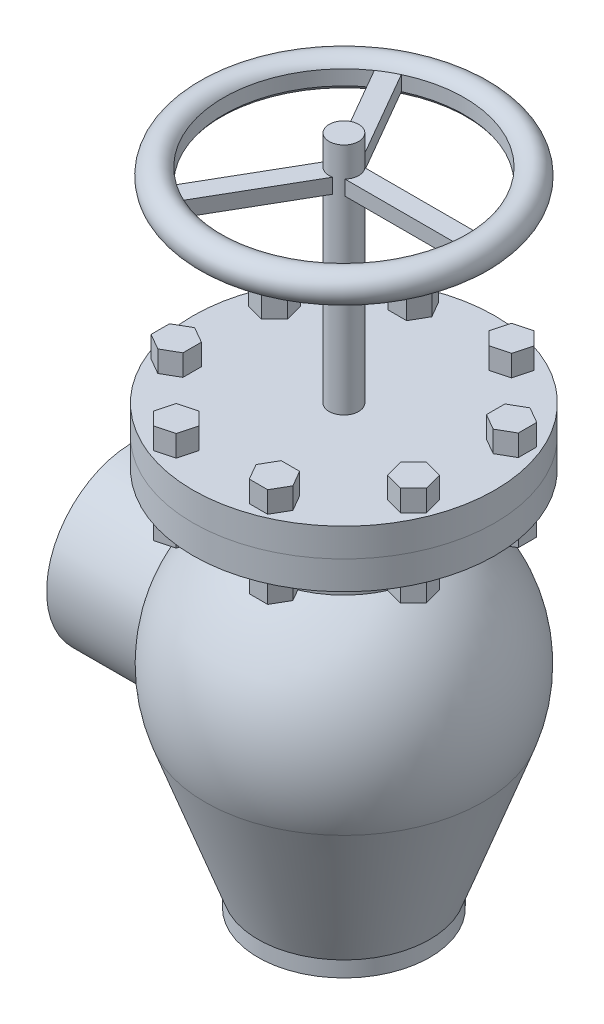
from build123d import *

# Parameters (mm, degrees)
WELD_END_SKETCH_R                = 72.263
WELD_END_DEPTH                   = 177.8
FLANGE_BOTTOM_SKETCH_R           = 127
FLANGE_BOTTOM_DEPTH              = 23.876
FLANGE_TOP_SKETCH_R              = 127
FLANGE_TOP_DEPTH                 = 23.876
CENTRE_SUPPORT_REACH             = 584.181
CENTRE_SUPPORT_SKETCH_R          = 12.446
CENTRE_SUPPORT_DIRECTION_2_DEPTH = 24.892
DRIVER_START                     = -12.446
DRIVER_CUT_DEPTH                 = 12.446
ID_PROFILE_R                     = 65.7098
BOLT_DEPTH                       = 83.566
BOLT_PATTERN_COUNT               = 8
BOLT_PATTERN_ANGLE               = 315


with BuildPart() as part:
    # Weld End Sketch → Weld End (new body)
    with BuildSketch(Plane(origin=(0, 0, 0), x_dir=(0, 0, -1), z_dir=(1, 0, 0))):
        Circle(WELD_END_SKETCH_R)
    extrude(amount=-WELD_END_DEPTH)

    # Body Sketch → Body (revolve)
    with BuildSketch(Plane.XY, mode=Mode.PRIVATE) as body_sk:
        with BuildLine():
            Line((-72.263, 142.24), (-72.263, 101.054591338))
            ThreePointArc((-72.263, 101.054591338), (-118.667388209, 36.769859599), (-116.741337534, -42.490371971))
            Line((-116.741337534, -42.490371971), (-72.263, -164.6936))
            Line((-72.263, -164.6936), (-72.263, -177.8))
            Line((-72.263, -177.8), (0, -177.8))
            Line((0, -177.8), (0, 142.24))
            Line((0, 142.24), (-72.263, 142.24))
        make_face()
    revolve(body_sk.sketch.rotate(Axis((0, -199.445830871, 0), (0, 1, 0)), 270), axis=Axis((0, -199.445830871, 0), (0, 1, 0)))

    # Flange Bottom Sketch → Flange Bottom (add)
    with BuildSketch(Plane(origin=(0, 142.24, 0), x_dir=(-1, 0, 0), z_dir=(0, 1, 0))):
        with Locations(Location((0, 0, 0), (0, 0, 90))):
            Circle(FLANGE_BOTTOM_SKETCH_R)
    extrude(amount=FLANGE_BOTTOM_DEPTH)

    # Flange Top Sketch → Flange Top (add)
    with BuildSketch(Plane(origin=(0, 166.116, 0), x_dir=(-1, 0, 0), z_dir=(0, 1, 0))):
        with Locations(Location((0, 0, 0), (0, 0, 90))):
            Circle(FLANGE_TOP_SKETCH_R)
    extrude(amount=FLANGE_TOP_DEPTH)

    # Centre Support: up to this face of the body (flat: up to its plane)
    centre_support_end = Plane(part.part.faces().sort_by_distance((0, 189.992, 0))[0])
    # Centre Support Sketch → Centre Support (add, up to the picked face)
    with BuildSketch(Plane(origin=(0, 361.823, 0), x_dir=(-1, 0, 0), z_dir=(0, 1, 0)), mode=Mode.PRIVATE) as centre_support_sk1:
        with Locations(Location((0, 0, 0), (0, 0, 90))):
            Circle(CENTRE_SUPPORT_SKETCH_R)
    centre_support_tool1 = split(extrude(centre_support_sk1.sketch, amount=-CENTRE_SUPPORT_REACH, mode=Mode.PRIVATE), bisect_by=centre_support_end, keep=Keep.BOTH, mode=Mode.PRIVATE)


with BuildPart() as body_2:
    # Driver Sweep: sweep along a path in Driver Path
    with BuildLine(Plane(origin=(0, 355.6, 0), x_dir=(-1, 0, 0), z_dir=(0, 1, 0))) as driver_sweep_path:
        CenterArc((0, 0), 124.46, 0, 360)
    # Driver Profile → Driver Sweep (sweep)
    with BuildSketch(Plane.XY):
        with BuildLine():
            Line((-101.235447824, 361.823), (0, 361.823))
            Line((0, 361.823), (0, 349.377))
            Line((0, 349.377), (-101.235447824, 349.377))
            ThreePointArc((-101.235447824, 349.377), (-124.46, 355.6), (-101.235447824, 361.823))
        make_face()
    sweep(path=driver_sweep_path.line)


with BuildPart() as part_1:
    add(part.part)

    add(body_2.part)  # Centre Support merges body 2
    add(centre_support_tool1.solids().sort_by(Axis((0, 361.823, 0), (0, -1, 0)))[0])

    # Centre Support Sketch → Centre Support direction 2 (add)
    with BuildSketch(Plane(origin=(0, 361.823, 0), x_dir=(-1, 0, 0), z_dir=(0, 1, 0))):
        with Locations(Location((0, 0, 0), (0, 0, 90))):
            Circle(CENTRE_SUPPORT_SKETCH_R)
    extrude(amount=CENTRE_SUPPORT_DIRECTION_2_DEPTH)

    # Driver Cut Sketch → Driver Cut (cut)
    with BuildSketch(Plane(origin=(0, 361.823, 0), x_dir=(-1, 0, 0), z_dir=(0, 1, 0)).offset(DRIVER_START)):
        with BuildLine():
            Line((43.261722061, 91.526167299), (-2.547351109, 12.182525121))
            ThreePointArc((-2.547351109, 12.182525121), (-6.223, 10.778552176), (-9.276700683, 8.297333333))
            Line((-9.276700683, 8.297333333), (-100.894847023, 8.297333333))
            ThreePointArc((-100.894847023, 8.297333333), (-50.617723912, 87.67246958), (43.261722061, 91.526167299))
        make_face()
        with BuildLine():
            Line((-100.894847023, -8.297333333), (-9.276700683, -8.297333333))
            ThreePointArc((-9.276700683, -8.297333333), (-6.223, -10.778552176), (-2.547351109, -12.182525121))
            Line((-2.547351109, -12.182525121), (43.261722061, -91.526167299))
            ThreePointArc((43.261722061, -91.526167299), (-50.617723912, -87.67246958), (-100.894847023, -8.297333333))
        make_face()
        with BuildLine():
            Line((57.633124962, 83.228833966), (11.824051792, 3.885191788))
            ThreePointArc((11.824051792, 3.885191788), (12.446, 0), (11.824051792, -3.885191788))
            Line((11.824051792, -3.885191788), (57.633124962, -83.228833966))
            ThreePointArc((57.633124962, -83.228833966), (101.235447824, 0), (57.633124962, 83.228833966))
        make_face()
    extrude(amount=DRIVER_CUT_DEPTH, mode=Mode.SUBTRACT)

    # ID Cut: sweep along a path in ID Path
    with BuildLine(Plane.XY) as id_cut_path:
        Line((-177.8, 0), (0, 0))
        Line((0, 0), (0, -177.8))
    # ID Profile → ID Cut (sweep, cut)
    with BuildSketch(Plane.ZY.offset(177.8)):
        Circle(ID_PROFILE_R)
    sweep(path=id_cut_path.line, transition=Transition.RIGHT, mode=Mode.SUBTRACT)

    # Bolt Sketch → Bolt (add)
    with BuildSketch(Plane(origin=(0, 207.899, 0), x_dir=(-1, 0, 0), z_dir=(0, 1, 0))):
        Polygon((-99.732795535, -25.824756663), (-113.143995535, -33.567716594), (-113.143995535, -49.053636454), (-99.732795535, -56.796596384), (-86.321595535, -49.053636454), (-86.321595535, -33.567716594), align=None)
    bolt = extrude(amount=-BOLT_DEPTH)

    # Bolt Pattern: Bolt ×8 about axis
    bolt_pattern_axis = Axis((0, 166.116, 0), (0, -1, 0))
    for i in range(1, BOLT_PATTERN_COUNT):
        add(bolt.rotate(bolt_pattern_axis, i * BOLT_PATTERN_ANGLE / (BOLT_PATTERN_COUNT - 1)))


solid = part_1.part
